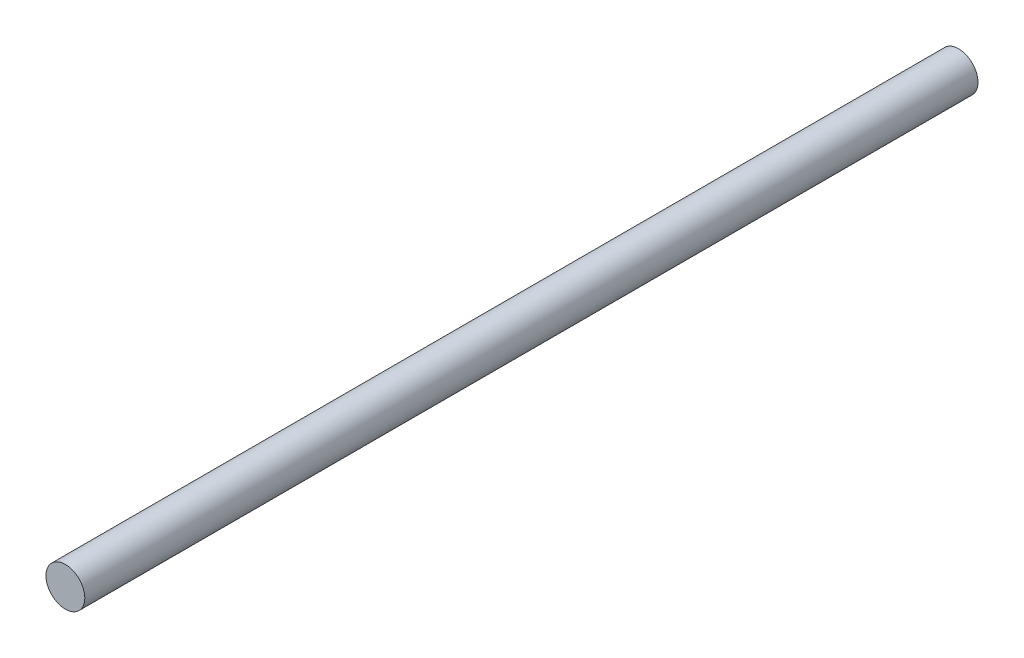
from build123d import *

# Parameters (mm, degrees)
ESQUISSE1_R        = 1.5
BOSS_EXTRU_1_DEPTH = 69


with BuildPart() as part:
    # Esquisse1 → Boss.-Extru.1 (new body)
    with BuildSketch(Plane.XY):
        Circle(ESQUISSE1_R)
    extrude(amount=BOSS_EXTRU_1_DEPTH)


solid = part.part
